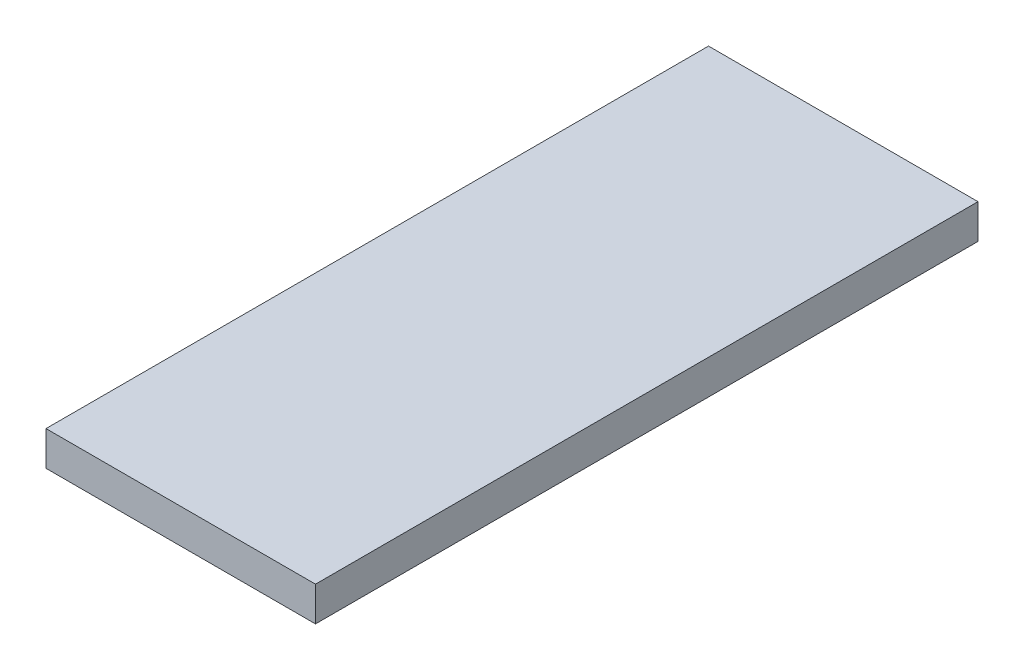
ISO-10303-21;
HEADER;
FILE_DESCRIPTION(('STEP AP214'),'2;1');
FILE_NAME('part.step','',(''),(''),'','','');
FILE_SCHEMA(('AUTOMOTIVE_DESIGN { 1 0 10303 214 1 1 1 1 }'));
ENDSEC;
DATA;
#1=APPLICATION_CONTEXT('core data for automotive mechanical design processes');
#2=APPLICATION_PROTOCOL_DEFINITION('international standard','automotive_design',2000,#1);
#3=PRODUCT_CONTEXT('',#1,'mechanical');
#4=PRODUCT('Part','Part','',(#3));
#5=PRODUCT_RELATED_PRODUCT_CATEGORY('part','',(#4));
#6=PRODUCT_DEFINITION_FORMATION('','',#4);
#7=PRODUCT_DEFINITION_CONTEXT('part definition',#1,'design');
#8=PRODUCT_DEFINITION('design','',#6,#7);
#9=PRODUCT_DEFINITION_SHAPE('','',#8);
#10=(LENGTH_UNIT() NAMED_UNIT(*) SI_UNIT(.MILLI.,.METRE.));
#11=(NAMED_UNIT(*) PLANE_ANGLE_UNIT() SI_UNIT($,.RADIAN.));
#12=(NAMED_UNIT(*) SI_UNIT($,.STERADIAN.) SOLID_ANGLE_UNIT());
#13=UNCERTAINTY_MEASURE_WITH_UNIT(LENGTH_MEASURE(1.E-05),#10,'distance_accuracy_value','');
#14=(GEOMETRIC_REPRESENTATION_CONTEXT(3) GLOBAL_UNCERTAINTY_ASSIGNED_CONTEXT((#13)) GLOBAL_UNIT_ASSIGNED_CONTEXT((#10,
#11,#12)) REPRESENTATION_CONTEXT('',''));
#15=CARTESIAN_POINT('',(0.,0.,0.));
#16=DIRECTION('',(0.,0.,1.));
#17=DIRECTION('',(1.,0.,0.));
#18=AXIS2_PLACEMENT_3D('',#15,#16,#17);
#19=CARTESIAN_POINT('',(-4.22066394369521,-1.83507127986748,-30.));
#20=DIRECTION('',(1.,0.,0.));
#21=DIRECTION('',(0.,0.,-1.));
#22=AXIS2_PLACEMENT_3D('',#19,#20,#21);
#23=PLANE('',#22);
#24=DIRECTION('',(0.,0.,1.));
#25=VECTOR('',#24,1.);
#26=CARTESIAN_POINT('',(-4.22066394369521,-1.83507127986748,-30.));
#27=LINE('',#26,#25);
#28=CARTESIAN_POINT('',(-4.22066394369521,-1.83507127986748,-30.));
#29=VERTEX_POINT('',#28);
#30=CARTESIAN_POINT('',(-4.22066394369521,-1.83507127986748,30.));
#31=VERTEX_POINT('',#30);
#32=EDGE_CURVE('E42',#29,#31,#27,.T.);
#33=ORIENTED_EDGE('',*,*,#32,.T.);
#34=DIRECTION('',(0.,1.,0.));
#35=VECTOR('',#34,1.);
#36=CARTESIAN_POINT('',(-4.22066394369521,-1.83507127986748,30.));
#37=LINE('',#36,#35);
#38=CARTESIAN_POINT('',(-4.22066394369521,-4.9546924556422,30.));
#39=VERTEX_POINT('',#38);
#40=EDGE_CURVE('E79',#39,#31,#37,.T.);
#41=ORIENTED_EDGE('',*,*,#40,.F.);
#42=DIRECTION('',(0.,0.,1.));
#43=VECTOR('',#42,1.);
#44=CARTESIAN_POINT('',(-4.22066394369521,-4.9546924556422,-30.));
#45=LINE('',#44,#43);
#46=CARTESIAN_POINT('',(-4.22066394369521,-4.9546924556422,-30.));
#47=VERTEX_POINT('',#46);
#48=EDGE_CURVE('E12',#47,#39,#45,.T.);
#49=ORIENTED_EDGE('',*,*,#48,.F.);
#50=DIRECTION('',(0.,1.,0.));
#51=VECTOR('',#50,1.);
#52=CARTESIAN_POINT('',(-4.22066394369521,-1.83507127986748,-30.));
#53=LINE('',#52,#51);
#54=EDGE_CURVE('E80',#47,#29,#53,.T.);
#55=ORIENTED_EDGE('',*,*,#54,.T.);
#56=EDGE_LOOP('',(#33,#41,#49,#55));
#57=FACE_BOUND('',#56,.T.);
#58=ADVANCED_FACE('F39',(#57),#23,.T.);
#59=CARTESIAN_POINT('',(-28.6271119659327,-4.9546924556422,-30.));
#60=DIRECTION('',(0.,-1.,0.));
#61=DIRECTION('',(0.,0.,-1.));
#62=AXIS2_PLACEMENT_3D('',#59,#60,#61);
#63=PLANE('',#62);
#64=ORIENTED_EDGE('',*,*,#48,.T.);
#65=DIRECTION('',(1.,0.,0.));
#66=VECTOR('',#65,1.);
#67=CARTESIAN_POINT('',(-28.6271119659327,-4.9546924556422,30.));
#68=LINE('',#67,#66);
#69=CARTESIAN_POINT('',(-28.6271119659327,-4.9546924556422,30.));
#70=VERTEX_POINT('',#69);
#71=EDGE_CURVE('E96',#70,#39,#68,.T.);
#72=ORIENTED_EDGE('',*,*,#71,.F.);
#73=DIRECTION('',(0.,0.,1.));
#74=VECTOR('',#73,1.);
#75=CARTESIAN_POINT('',(-28.6271119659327,-4.9546924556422,-30.));
#76=LINE('',#75,#74);
#77=CARTESIAN_POINT('',(-28.6271119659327,-4.9546924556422,-30.));
#78=VERTEX_POINT('',#77);
#79=EDGE_CURVE('E47',#78,#70,#76,.T.);
#80=ORIENTED_EDGE('',*,*,#79,.F.);
#81=DIRECTION('',(1.,0.,0.));
#82=VECTOR('',#81,1.);
#83=CARTESIAN_POINT('',(-28.6271119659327,-4.9546924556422,-30.));
#84=LINE('',#83,#82);
#85=EDGE_CURVE('E85',#78,#47,#84,.T.);
#86=ORIENTED_EDGE('',*,*,#85,.T.);
#87=EDGE_LOOP('',(#64,#72,#80,#86));
#88=FACE_BOUND('',#87,.T.);
#89=ADVANCED_FACE('F112',(#88),#63,.T.);
#90=CARTESIAN_POINT('',(-28.6271119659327,-1.83507127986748,-30.));
#91=DIRECTION('',(-1.,0.,0.));
#92=DIRECTION('',(0.,0.,1.));
#93=AXIS2_PLACEMENT_3D('',#90,#91,#92);
#94=PLANE('',#93);
#95=ORIENTED_EDGE('',*,*,#79,.T.);
#96=DIRECTION('',(0.,-1.,0.));
#97=VECTOR('',#96,1.);
#98=CARTESIAN_POINT('',(-28.6271119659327,-1.83507127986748,30.));
#99=LINE('',#98,#97);
#100=CARTESIAN_POINT('',(-28.6271119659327,-1.83507127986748,30.));
#101=VERTEX_POINT('',#100);
#102=EDGE_CURVE('E92',#101,#70,#99,.T.);
#103=ORIENTED_EDGE('',*,*,#102,.F.);
#104=DIRECTION('',(0.,0.,1.));
#105=VECTOR('',#104,1.);
#106=CARTESIAN_POINT('',(-28.6271119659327,-1.83507127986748,-30.));
#107=LINE('',#106,#105);
#108=CARTESIAN_POINT('',(-28.6271119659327,-1.83507127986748,-30.));
#109=VERTEX_POINT('',#108);
#110=EDGE_CURVE('E84',#109,#101,#107,.T.);
#111=ORIENTED_EDGE('',*,*,#110,.F.);
#112=DIRECTION('',(0.,-1.,0.));
#113=VECTOR('',#112,1.);
#114=CARTESIAN_POINT('',(-28.6271119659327,-1.83507127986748,-30.));
#115=LINE('',#114,#113);
#116=EDGE_CURVE('E105',#109,#78,#115,.T.);
#117=ORIENTED_EDGE('',*,*,#116,.T.);
#118=EDGE_LOOP('',(#95,#103,#111,#117));
#119=FACE_BOUND('',#118,.T.);
#120=ADVANCED_FACE('F109',(#119),#94,.T.);
#121=CARTESIAN_POINT('',(-28.6271119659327,-1.83507127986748,-30.));
#122=DIRECTION('',(0.,1.,0.));
#123=DIRECTION('',(0.,0.,1.));
#124=AXIS2_PLACEMENT_3D('',#121,#122,#123);
#125=PLANE('',#124);
#126=ORIENTED_EDGE('',*,*,#110,.T.);
#127=DIRECTION('',(-1.,0.,0.));
#128=VECTOR('',#127,1.);
#129=CARTESIAN_POINT('',(-28.6271119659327,-1.83507127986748,30.));
#130=LINE('',#129,#128);
#131=EDGE_CURVE('E87',#31,#101,#130,.T.);
#132=ORIENTED_EDGE('',*,*,#131,.F.);
#133=ORIENTED_EDGE('',*,*,#32,.F.);
#134=DIRECTION('',(-1.,0.,0.));
#135=VECTOR('',#134,1.);
#136=CARTESIAN_POINT('',(-28.6271119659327,-1.83507127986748,-30.));
#137=LINE('',#136,#135);
#138=EDGE_CURVE('E103',#29,#109,#137,.T.);
#139=ORIENTED_EDGE('',*,*,#138,.T.);
#140=EDGE_LOOP('',(#126,#132,#133,#139));
#141=FACE_BOUND('',#140,.T.);
#142=ADVANCED_FACE('F88',(#141),#125,.T.);
#143=CARTESIAN_POINT('',(-4.22066394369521,-4.9546924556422,-30.));
#144=DIRECTION('',(0.,0.,1.));
#145=DIRECTION('',(1.,0.,0.));
#146=AXIS2_PLACEMENT_3D('',#143,#144,#145);
#147=PLANE('',#146);
#148=ORIENTED_EDGE('',*,*,#54,.F.);
#149=ORIENTED_EDGE('',*,*,#85,.F.);
#150=ORIENTED_EDGE('',*,*,#116,.F.);
#151=ORIENTED_EDGE('',*,*,#138,.F.);
#152=EDGE_LOOP('',(#148,#149,#150,#151));
#153=FACE_BOUND('',#152,.T.);
#154=ADVANCED_FACE('F114',(#153),#147,.F.);
#155=CARTESIAN_POINT('',(-4.22066394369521,-4.9546924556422,30.));
#156=DIRECTION('',(0.,0.,1.));
#157=DIRECTION('',(1.,0.,0.));
#158=AXIS2_PLACEMENT_3D('',#155,#156,#157);
#159=PLANE('',#158);
#160=ORIENTED_EDGE('',*,*,#40,.T.);
#161=ORIENTED_EDGE('',*,*,#131,.T.);
#162=ORIENTED_EDGE('',*,*,#102,.T.);
#163=ORIENTED_EDGE('',*,*,#71,.T.);
#164=EDGE_LOOP('',(#160,#161,#162,#163));
#165=FACE_BOUND('',#164,.T.);
#166=ADVANCED_FACE('F95',(#165),#159,.T.);
#167=CLOSED_SHELL('',(#58,#89,#120,#142,#154,#166));
#168=MANIFOLD_SOLID_BREP('B2',#167);
#169=ADVANCED_BREP_SHAPE_REPRESENTATION('',(#18,#168),#14);
#170=SHAPE_DEFINITION_REPRESENTATION(#9,#169);
ENDSEC;
END-ISO-10303-21;
